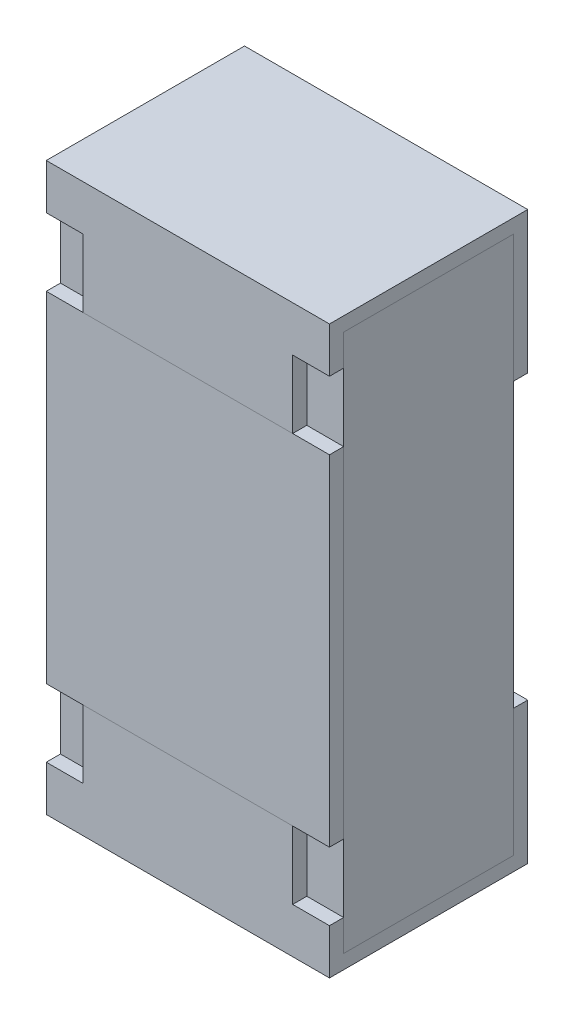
ISO-10303-21;
HEADER;
FILE_DESCRIPTION(('STEP AP214'),'2;1');
FILE_NAME('part.step','',(''),(''),'','','');
FILE_SCHEMA(('AUTOMOTIVE_DESIGN { 1 0 10303 214 1 1 1 1 }'));
ENDSEC;
DATA;
#1=APPLICATION_CONTEXT('core data for automotive mechanical design processes');
#2=APPLICATION_PROTOCOL_DEFINITION('international standard','automotive_design',2000,#1);
#3=PRODUCT_CONTEXT('',#1,'mechanical');
#4=PRODUCT('Part','Part','',(#3));
#5=PRODUCT_RELATED_PRODUCT_CATEGORY('part','',(#4));
#6=PRODUCT_DEFINITION_FORMATION('','',#4);
#7=PRODUCT_DEFINITION_CONTEXT('part definition',#1,'design');
#8=PRODUCT_DEFINITION('design','',#6,#7);
#9=PRODUCT_DEFINITION_SHAPE('','',#8);
#10=(LENGTH_UNIT() NAMED_UNIT(*) SI_UNIT(.MILLI.,.METRE.));
#11=(NAMED_UNIT(*) PLANE_ANGLE_UNIT() SI_UNIT($,.RADIAN.));
#12=(NAMED_UNIT(*) SI_UNIT($,.STERADIAN.) SOLID_ANGLE_UNIT());
#13=UNCERTAINTY_MEASURE_WITH_UNIT(LENGTH_MEASURE(1.E-05),#10,'distance_accuracy_value','');
#14=(GEOMETRIC_REPRESENTATION_CONTEXT(3) GLOBAL_UNCERTAINTY_ASSIGNED_CONTEXT((#13)) GLOBAL_UNIT_ASSIGNED_CONTEXT((#10,
#11,#12)) REPRESENTATION_CONTEXT('',''));
#15=CARTESIAN_POINT('',(0.,0.,0.));
#16=DIRECTION('',(0.,0.,1.));
#17=DIRECTION('',(1.,0.,0.));
#18=AXIS2_PLACEMENT_3D('',#15,#16,#17);
#19=CARTESIAN_POINT('',(15.435,34.38,0.355));
#20=DIRECTION('',(-1.,0.,0.));
#21=DIRECTION('',(0.,0.,1.));
#22=AXIS2_PLACEMENT_3D('',#19,#20,#21);
#23=PLANE('',#22);
#24=DIRECTION('',(0.,0.,-1.));
#25=VECTOR('',#24,1.);
#26=CARTESIAN_POINT('',(15.435,34.26,0.355));
#27=LINE('',#26,#25);
#28=CARTESIAN_POINT('',(15.435,34.26,0.38));
#29=VERTEX_POINT('',#28);
#30=CARTESIAN_POINT('',(15.435,34.26,0.355));
#31=VERTEX_POINT('',#30);
#32=EDGE_CURVE('P0_E20',#29,#31,#27,.T.);
#33=ORIENTED_EDGE('',*,*,#32,.T.);
#34=DIRECTION('',(0.,-1.,0.));
#35=VECTOR('',#34,1.);
#36=CARTESIAN_POINT('',(15.435,33.6918753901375,0.354999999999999));
#37=LINE('',#36,#35);
#38=CARTESIAN_POINT('',(15.435,34.38,0.355));
#39=VERTEX_POINT('',#38);
#40=EDGE_CURVE('P0_E103',#31,#39,#37,.F.);
#41=ORIENTED_EDGE('',*,*,#40,.T.);
#42=DIRECTION('',(0.,0.,1.));
#43=VECTOR('',#42,1.);
#44=CARTESIAN_POINT('',(15.435,34.38,0.38));
#45=LINE('',#44,#43);
#46=CARTESIAN_POINT('',(15.435,34.38,0.38));
#47=VERTEX_POINT('',#46);
#48=EDGE_CURVE('P0_E111',#39,#47,#45,.T.);
#49=ORIENTED_EDGE('',*,*,#48,.T.);
#50=DIRECTION('',(0.,1.,0.));
#51=VECTOR('',#50,1.);
#52=CARTESIAN_POINT('',(15.435,33.6918753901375,0.38));
#53=LINE('',#52,#51);
#54=EDGE_CURVE('P0_E108',#47,#29,#53,.F.);
#55=ORIENTED_EDGE('',*,*,#54,.T.);
#56=EDGE_LOOP('',(#33,#41,#49,#55));
#57=FACE_BOUND('',#56,.T.);
#58=ADVANCED_FACE('P0_F17',(#57),#23,.F.);
#59=CARTESIAN_POINT('',(15.5,34.26,0.355));
#60=DIRECTION('',(0.,-1.,0.));
#61=DIRECTION('',(0.,0.,-1.));
#62=AXIS2_PLACEMENT_3D('',#59,#60,#61);
#63=PLANE('',#62);
#64=DIRECTION('',(0.,0.,1.));
#65=VECTOR('',#64,1.);
#66=CARTESIAN_POINT('',(15.5,34.26,0.38));
#67=LINE('',#66,#65);
#68=CARTESIAN_POINT('',(15.5,34.26,0.38));
#69=VERTEX_POINT('',#68);
#70=CARTESIAN_POINT('',(15.5,34.26,0.355));
#71=VERTEX_POINT('',#70);
#72=EDGE_CURVE('P0_E116',#69,#71,#67,.F.);
#73=ORIENTED_EDGE('',*,*,#72,.T.);
#74=DIRECTION('',(1.,0.,0.));
#75=VECTOR('',#74,1.);
#76=CARTESIAN_POINT('',(15.5,34.26,0.354999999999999));
#77=LINE('',#76,#75);
#78=EDGE_CURVE('P0_E113',#71,#31,#77,.F.);
#79=ORIENTED_EDGE('',*,*,#78,.T.);
#80=ORIENTED_EDGE('',*,*,#32,.F.);
#81=DIRECTION('',(1.,0.,0.));
#82=VECTOR('',#81,1.);
#83=CARTESIAN_POINT('',(15.,34.26,0.38));
#84=LINE('',#83,#82);
#85=EDGE_CURVE('P0_E150',#29,#69,#84,.T.);
#86=ORIENTED_EDGE('',*,*,#85,.T.);
#87=EDGE_LOOP('',(#73,#79,#80,#86));
#88=FACE_BOUND('',#87,.T.);
#89=ADVANCED_FACE('P0_F114',(#88),#63,.F.);
#90=CARTESIAN_POINT('',(15.065,34.38,0.355));
#91=DIRECTION('',(1.,0.,0.));
#92=DIRECTION('',(0.,1.,0.));
#93=AXIS2_PLACEMENT_3D('',#90,#91,#92);
#94=PLANE('',#93);
#95=DIRECTION('',(0.,0.,1.));
#96=VECTOR('',#95,1.);
#97=CARTESIAN_POINT('',(15.065,34.38,0.38));
#98=LINE('',#97,#96);
#99=CARTESIAN_POINT('',(15.065,34.38,0.38));
#100=VERTEX_POINT('',#99);
#101=CARTESIAN_POINT('',(15.065,34.38,0.355));
#102=VERTEX_POINT('',#101);
#103=EDGE_CURVE('P0_E136',#100,#102,#98,.F.);
#104=ORIENTED_EDGE('',*,*,#103,.T.);
#105=DIRECTION('',(0.,-1.,0.));
#106=VECTOR('',#105,1.);
#107=CARTESIAN_POINT('',(15.065,33.6918753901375,0.354999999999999));
#108=LINE('',#107,#106);
#109=CARTESIAN_POINT('',(15.065,34.26,0.355));
#110=VERTEX_POINT('',#109);
#111=EDGE_CURVE('P0_E128',#102,#110,#108,.T.);
#112=ORIENTED_EDGE('',*,*,#111,.T.);
#113=DIRECTION('',(0.,0.,-1.));
#114=VECTOR('',#113,1.);
#115=CARTESIAN_POINT('',(15.065,34.26,0.355));
#116=LINE('',#115,#114);
#117=CARTESIAN_POINT('',(15.065,34.26,0.38));
#118=VERTEX_POINT('',#117);
#119=EDGE_CURVE('P0_E169',#110,#118,#116,.F.);
#120=ORIENTED_EDGE('',*,*,#119,.T.);
#121=DIRECTION('',(0.,1.,0.));
#122=VECTOR('',#121,1.);
#123=CARTESIAN_POINT('',(15.065,33.6918753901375,0.38));
#124=LINE('',#123,#122);
#125=EDGE_CURVE('P0_E146',#118,#100,#124,.T.);
#126=ORIENTED_EDGE('',*,*,#125,.T.);
#127=EDGE_LOOP('',(#104,#112,#120,#126));
#128=FACE_BOUND('',#127,.T.);
#129=ADVANCED_FACE('P0_F174',(#128),#94,.F.);
#130=CARTESIAN_POINT('',(15.,34.38,0.38));
#131=DIRECTION('',(0.,-1.,0.));
#132=DIRECTION('',(1.,0.,0.));
#133=AXIS2_PLACEMENT_3D('',#130,#131,#132);
#134=PLANE('',#133);
#135=ORIENTED_EDGE('',*,*,#103,.F.);
#136=DIRECTION('',(1.,0.,0.));
#137=VECTOR('',#136,1.);
#138=CARTESIAN_POINT('',(15.,34.38,0.38));
#139=LINE('',#138,#137);
#140=EDGE_CURVE('P0_E141',#100,#47,#139,.T.);
#141=ORIENTED_EDGE('',*,*,#140,.T.);
#142=ORIENTED_EDGE('',*,*,#48,.F.);
#143=DIRECTION('',(1.,0.,0.));
#144=VECTOR('',#143,1.);
#145=CARTESIAN_POINT('',(15.5,34.38,0.354999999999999));
#146=LINE('',#145,#144);
#147=EDGE_CURVE('P0_E126',#39,#102,#146,.F.);
#148=ORIENTED_EDGE('',*,*,#147,.T.);
#149=EDGE_LOOP('',(#135,#141,#142,#148));
#150=FACE_BOUND('',#149,.T.);
#151=ADVANCED_FACE('P0_F142',(#150),#134,.F.);
#152=CARTESIAN_POINT('',(15.5,34.205,0.0549999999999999));
#153=DIRECTION('',(0.,0.,-1.));
#154=DIRECTION('',(0.,1.,0.));
#155=AXIS2_PLACEMENT_3D('',#152,#153,#154);
#156=PLANE('',#155);
#157=DIRECTION('',(0.,1.,0.));
#158=VECTOR('',#157,1.);
#159=CARTESIAN_POINT('',(15.,33.6918753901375,0.0549999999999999));
#160=LINE('',#159,#158);
#161=CARTESIAN_POINT('',(15.,34.43,0.0549999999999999));
#162=VERTEX_POINT('',#161);
#163=CARTESIAN_POINT('',(15.,34.205,0.055));
#164=VERTEX_POINT('',#163);
#165=EDGE_CURVE('P0_E219',#162,#164,#160,.F.);
#166=ORIENTED_EDGE('',*,*,#165,.T.);
#167=DIRECTION('',(-1.,0.,0.));
#168=VECTOR('',#167,1.);
#169=CARTESIAN_POINT('',(15.5,34.205,0.0550000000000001));
#170=LINE('',#169,#168);
#171=CARTESIAN_POINT('',(15.5,34.205,0.055));
#172=VERTEX_POINT('',#171);
#173=EDGE_CURVE('P0_E133',#172,#164,#170,.T.);
#174=ORIENTED_EDGE('',*,*,#173,.F.);
#175=DIRECTION('',(0.,-1.,0.));
#176=VECTOR('',#175,1.);
#177=CARTESIAN_POINT('',(15.5,33.6918753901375,0.0550000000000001));
#178=LINE('',#177,#176);
#179=CARTESIAN_POINT('',(15.5,34.43,0.055));
#180=VERTEX_POINT('',#179);
#181=EDGE_CURVE('P0_E161',#172,#180,#178,.F.);
#182=ORIENTED_EDGE('',*,*,#181,.T.);
#183=DIRECTION('',(-1.,0.,0.));
#184=VECTOR('',#183,1.);
#185=CARTESIAN_POINT('',(15.25,34.43,0.0549999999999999));
#186=LINE('',#185,#184);
#187=EDGE_CURVE('P0_E166',#162,#180,#186,.F.);
#188=ORIENTED_EDGE('',*,*,#187,.F.);
#189=EDGE_LOOP('',(#166,#174,#182,#188));
#190=FACE_BOUND('',#189,.T.);
#191=ADVANCED_FACE('P0_F229',(#190),#156,.F.);
#192=CARTESIAN_POINT('',(15.5,34.205,0.355));
#193=DIRECTION('',(0.,1.,0.));
#194=DIRECTION('',(-1.,0.,0.));
#195=AXIS2_PLACEMENT_3D('',#192,#193,#194);
#196=PLANE('',#195);
#197=DIRECTION('',(0.,0.,1.));
#198=VECTOR('',#197,1.);
#199=CARTESIAN_POINT('',(15.5,34.205,0.38));
#200=LINE('',#199,#198);
#201=CARTESIAN_POINT('',(15.5,34.205,0.355));
#202=VERTEX_POINT('',#201);
#203=EDGE_CURVE('P0_E163',#202,#172,#200,.F.);
#204=ORIENTED_EDGE('',*,*,#203,.T.);
#205=ORIENTED_EDGE('',*,*,#173,.T.);
#206=DIRECTION('',(0.,0.,-1.));
#207=VECTOR('',#206,1.);
#208=CARTESIAN_POINT('',(15.,34.205,0.354999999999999));
#209=LINE('',#208,#207);
#210=CARTESIAN_POINT('',(15.,34.205,0.355));
#211=VERTEX_POINT('',#210);
#212=EDGE_CURVE('P0_E217',#164,#211,#209,.F.);
#213=ORIENTED_EDGE('',*,*,#212,.T.);
#214=DIRECTION('',(1.,0.,0.));
#215=VECTOR('',#214,1.);
#216=CARTESIAN_POINT('',(15.5,34.205,0.354999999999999));
#217=LINE('',#216,#215);
#218=EDGE_CURVE('P0_E120',#211,#202,#217,.T.);
#219=ORIENTED_EDGE('',*,*,#218,.T.);
#220=EDGE_LOOP('',(#204,#205,#213,#219));
#221=FACE_BOUND('',#220,.T.);
#222=ADVANCED_FACE('P0_F231',(#221),#196,.T.);
#223=CARTESIAN_POINT('',(15.5,33.6918753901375,0.354999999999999));
#224=DIRECTION('',(0.,0.,1.));
#225=DIRECTION('',(0.,-1.,0.));
#226=AXIS2_PLACEMENT_3D('',#223,#224,#225);
#227=PLANE('',#226);
#228=ORIENTED_EDGE('',*,*,#111,.F.);
#229=ORIENTED_EDGE('',*,*,#147,.F.);
#230=ORIENTED_EDGE('',*,*,#40,.F.);
#231=ORIENTED_EDGE('',*,*,#78,.F.);
#232=DIRECTION('',(0.,-1.,0.));
#233=VECTOR('',#232,1.);
#234=CARTESIAN_POINT('',(15.5,33.6918753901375,0.355));
#235=LINE('',#234,#233);
#236=EDGE_CURVE('P0_E151',#71,#202,#235,.T.);
#237=ORIENTED_EDGE('',*,*,#236,.T.);
#238=ORIENTED_EDGE('',*,*,#218,.F.);
#239=DIRECTION('',(0.,1.,0.));
#240=VECTOR('',#239,1.);
#241=CARTESIAN_POINT('',(15.,33.6918753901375,0.355));
#242=LINE('',#241,#240);
#243=CARTESIAN_POINT('',(15.,34.26,0.355));
#244=VERTEX_POINT('',#243);
#245=EDGE_CURVE('P0_E180',#211,#244,#242,.T.);
#246=ORIENTED_EDGE('',*,*,#245,.T.);
#247=DIRECTION('',(1.,0.,0.));
#248=VECTOR('',#247,1.);
#249=CARTESIAN_POINT('',(15.,34.26,0.355));
#250=LINE('',#249,#248);
#251=EDGE_CURVE('P0_E171',#244,#110,#250,.T.);
#252=ORIENTED_EDGE('',*,*,#251,.T.);
#253=EDGE_LOOP('',(#228,#229,#230,#231,#237,#238,#246,#252));
#254=FACE_BOUND('',#253,.T.);
#255=ADVANCED_FACE('P0_F124',(#254),#227,.F.);
#256=CARTESIAN_POINT('',(15.,34.26,0.355));
#257=DIRECTION('',(0.,-1.,0.));
#258=DIRECTION('',(0.,0.,-1.));
#259=AXIS2_PLACEMENT_3D('',#256,#257,#258);
#260=PLANE('',#259);
#261=ORIENTED_EDGE('',*,*,#119,.F.);
#262=ORIENTED_EDGE('',*,*,#251,.F.);
#263=DIRECTION('',(0.,0.,-1.));
#264=VECTOR('',#263,1.);
#265=CARTESIAN_POINT('',(15.,34.26,0.354999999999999));
#266=LINE('',#265,#264);
#267=CARTESIAN_POINT('',(15.,34.26,0.38));
#268=VERTEX_POINT('',#267);
#269=EDGE_CURVE('P0_E186',#244,#268,#266,.F.);
#270=ORIENTED_EDGE('',*,*,#269,.T.);
#271=DIRECTION('',(1.,0.,0.));
#272=VECTOR('',#271,1.);
#273=CARTESIAN_POINT('',(15.,34.26,0.38));
#274=LINE('',#273,#272);
#275=EDGE_CURVE('P0_E185',#268,#118,#274,.T.);
#276=ORIENTED_EDGE('',*,*,#275,.T.);
#277=EDGE_LOOP('',(#261,#262,#270,#276));
#278=FACE_BOUND('',#277,.T.);
#279=ADVANCED_FACE('P0_F183',(#278),#260,.F.);
#280=CARTESIAN_POINT('',(15.25,34.43,0.0425000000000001));
#281=DIRECTION('',(0.,1.,0.));
#282=DIRECTION('',(-1.,0.,0.));
#283=AXIS2_PLACEMENT_3D('',#280,#281,#282);
#284=PLANE('',#283);
#285=DIRECTION('',(0.,0.,1.));
#286=VECTOR('',#285,1.);
#287=CARTESIAN_POINT('',(15.5,34.43,0.38));
#288=LINE('',#287,#286);
#289=CARTESIAN_POINT('',(15.5,34.43,0.03));
#290=VERTEX_POINT('',#289);
#291=EDGE_CURVE('P0_E159',#180,#290,#288,.F.);
#292=ORIENTED_EDGE('',*,*,#291,.T.);
#293=DIRECTION('',(1.,0.,0.));
#294=VECTOR('',#293,1.);
#295=CARTESIAN_POINT('',(15.,34.43,0.03));
#296=LINE('',#295,#294);
#297=CARTESIAN_POINT('',(15.,34.43,0.03));
#298=VERTEX_POINT('',#297);
#299=EDGE_CURVE('P0_E205',#290,#298,#296,.F.);
#300=ORIENTED_EDGE('',*,*,#299,.T.);
#301=DIRECTION('',(0.,0.,-1.));
#302=VECTOR('',#301,1.);
#303=CARTESIAN_POINT('',(15.,34.43,0.354999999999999));
#304=LINE('',#303,#302);
#305=EDGE_CURVE('P0_E145',#298,#162,#304,.F.);
#306=ORIENTED_EDGE('',*,*,#305,.T.);
#307=ORIENTED_EDGE('',*,*,#187,.T.);
#308=EDGE_LOOP('',(#292,#300,#306,#307));
#309=FACE_BOUND('',#308,.T.);
#310=ADVANCED_FACE('P0_F223',(#309),#284,.T.);
#311=CARTESIAN_POINT('',(15.5,33.6918753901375,0.38));
#312=DIRECTION('',(-1.,0.,0.));
#313=DIRECTION('',(0.,-1.,0.));
#314=AXIS2_PLACEMENT_3D('',#311,#312,#313);
#315=PLANE('',#314);
#316=ORIENTED_EDGE('',*,*,#72,.F.);
#317=DIRECTION('',(0.,1.,0.));
#318=VECTOR('',#317,1.);
#319=CARTESIAN_POINT('',(15.5,33.6918753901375,0.38));
#320=LINE('',#319,#318);
#321=CARTESIAN_POINT('',(15.5,34.18,0.38));
#322=VERTEX_POINT('',#321);
#323=EDGE_CURVE('P0_E153',#69,#322,#320,.F.);
#324=ORIENTED_EDGE('',*,*,#323,.T.);
#325=DIRECTION('',(0.,0.,1.));
#326=VECTOR('',#325,1.);
#327=CARTESIAN_POINT('',(15.5,34.18,0.38));
#328=LINE('',#327,#326);
#329=CARTESIAN_POINT('',(15.5,34.18,0.03));
#330=VERTEX_POINT('',#329);
#331=EDGE_CURVE('P0_E196',#330,#322,#328,.T.);
#332=ORIENTED_EDGE('',*,*,#331,.F.);
#333=DIRECTION('',(0.,-1.,0.));
#334=VECTOR('',#333,1.);
#335=CARTESIAN_POINT('',(15.5,34.18,0.03));
#336=LINE('',#335,#334);
#337=EDGE_CURVE('P0_E208',#330,#290,#336,.F.);
#338=ORIENTED_EDGE('',*,*,#337,.T.);
#339=ORIENTED_EDGE('',*,*,#291,.F.);
#340=ORIENTED_EDGE('',*,*,#181,.F.);
#341=ORIENTED_EDGE('',*,*,#203,.F.);
#342=ORIENTED_EDGE('',*,*,#236,.F.);
#343=EDGE_LOOP('',(#316,#324,#332,#338,#339,#340,#341,#342));
#344=FACE_BOUND('',#343,.T.);
#345=ADVANCED_FACE('P0_F193',(#344),#315,.F.);
#346=CARTESIAN_POINT('',(15.,33.6918753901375,0.38));
#347=DIRECTION('',(0.,0.,-1.));
#348=DIRECTION('',(0.,1.,0.));
#349=AXIS2_PLACEMENT_3D('',#346,#347,#348);
#350=PLANE('',#349);
#351=ORIENTED_EDGE('',*,*,#125,.F.);
#352=ORIENTED_EDGE('',*,*,#275,.F.);
#353=DIRECTION('',(0.,1.,0.));
#354=VECTOR('',#353,1.);
#355=CARTESIAN_POINT('',(15.,33.6918753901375,0.38));
#356=LINE('',#355,#354);
#357=CARTESIAN_POINT('',(15.,34.18,0.38));
#358=VERTEX_POINT('',#357);
#359=EDGE_CURVE('P0_E200',#268,#358,#356,.F.);
#360=ORIENTED_EDGE('',*,*,#359,.T.);
#361=DIRECTION('',(1.,0.,0.));
#362=VECTOR('',#361,1.);
#363=CARTESIAN_POINT('',(15.,34.18,0.38));
#364=LINE('',#363,#362);
#365=EDGE_CURVE('P0_E199',#322,#358,#364,.F.);
#366=ORIENTED_EDGE('',*,*,#365,.F.);
#367=ORIENTED_EDGE('',*,*,#323,.F.);
#368=ORIENTED_EDGE('',*,*,#85,.F.);
#369=ORIENTED_EDGE('',*,*,#54,.F.);
#370=ORIENTED_EDGE('',*,*,#140,.F.);
#371=EDGE_LOOP('',(#351,#352,#360,#366,#367,#368,#369,#370));
#372=FACE_BOUND('',#371,.T.);
#373=ADVANCED_FACE('P0_F148',(#372),#350,.F.);
#374=CARTESIAN_POINT('',(15.,33.6918753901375,0.354999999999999));
#375=DIRECTION('',(1.,0.,0.));
#376=DIRECTION('',(0.,0.,-1.));
#377=AXIS2_PLACEMENT_3D('',#374,#375,#376);
#378=PLANE('',#377);
#379=ORIENTED_EDGE('',*,*,#269,.F.);
#380=ORIENTED_EDGE('',*,*,#245,.F.);
#381=ORIENTED_EDGE('',*,*,#212,.F.);
#382=ORIENTED_EDGE('',*,*,#165,.F.);
#383=ORIENTED_EDGE('',*,*,#305,.F.);
#384=DIRECTION('',(0.,-1.,0.));
#385=VECTOR('',#384,1.);
#386=CARTESIAN_POINT('',(15.,34.18,0.03));
#387=LINE('',#386,#385);
#388=CARTESIAN_POINT('',(15.,34.18,0.0299999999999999));
#389=VERTEX_POINT('',#388);
#390=EDGE_CURVE('P0_E35',#298,#389,#387,.T.);
#391=ORIENTED_EDGE('',*,*,#390,.T.);
#392=DIRECTION('',(0.,0.,1.));
#393=VECTOR('',#392,1.);
#394=CARTESIAN_POINT('',(15.,34.18,0.38));
#395=LINE('',#394,#393);
#396=EDGE_CURVE('P0_E26',#358,#389,#395,.F.);
#397=ORIENTED_EDGE('',*,*,#396,.F.);
#398=ORIENTED_EDGE('',*,*,#359,.F.);
#399=EDGE_LOOP('',(#379,#380,#381,#382,#383,#391,#397,#398));
#400=FACE_BOUND('',#399,.T.);
#401=ADVANCED_FACE('P0_F227',(#400),#378,.F.);
#402=CARTESIAN_POINT('',(15.,34.18,0.03));
#403=DIRECTION('',(0.,0.,1.));
#404=DIRECTION('',(0.,-1.,0.));
#405=AXIS2_PLACEMENT_3D('',#402,#403,#404);
#406=PLANE('',#405);
#407=ORIENTED_EDGE('',*,*,#337,.F.);
#408=DIRECTION('',(1.,0.,0.));
#409=VECTOR('',#408,1.);
#410=CARTESIAN_POINT('',(15.,34.18,0.0299999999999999));
#411=LINE('',#410,#409);
#412=EDGE_CURVE('P0_E11',#389,#330,#411,.T.);
#413=ORIENTED_EDGE('',*,*,#412,.F.);
#414=ORIENTED_EDGE('',*,*,#390,.F.);
#415=ORIENTED_EDGE('',*,*,#299,.F.);
#416=EDGE_LOOP('',(#407,#413,#414,#415));
#417=FACE_BOUND('',#416,.T.);
#418=ADVANCED_FACE('P0_F235',(#417),#406,.F.);
#419=CARTESIAN_POINT('',(15.,34.18,0.38));
#420=DIRECTION('',(0.,-1.,0.));
#421=DIRECTION('',(1.,0.,0.));
#422=AXIS2_PLACEMENT_3D('',#419,#420,#421);
#423=PLANE('',#422);
#424=ORIENTED_EDGE('',*,*,#396,.T.);
#425=ORIENTED_EDGE('',*,*,#412,.T.);
#426=ORIENTED_EDGE('',*,*,#331,.T.);
#427=ORIENTED_EDGE('',*,*,#365,.T.);
#428=EDGE_LOOP('',(#424,#425,#426,#427));
#429=FACE_BOUND('',#428,.T.);
#430=ADVANCED_FACE('P0_F204',(#429),#423,.T.);
#431=CLOSED_SHELL('',(#58,#89,#129,#151,#191,#222,#255,#279,#310,#345,#373,#401,#418,#430));
#432=MANIFOLD_SOLID_BREP('P0_B1',#431);
#433=CARTESIAN_POINT('',(15.5,35.155,0.355));
#434=DIRECTION('',(0.,0.,-1.));
#435=DIRECTION('',(-1.,0.,0.));
#436=AXIS2_PLACEMENT_3D('',#433,#434,#435);
#437=PLANE('',#436);
#438=DIRECTION('',(-1.,0.,0.));
#439=VECTOR('',#438,1.);
#440=CARTESIAN_POINT('',(15.5,34.205,0.355));
#441=LINE('',#440,#439);
#442=CARTESIAN_POINT('',(15.,34.205,0.355));
#443=VERTEX_POINT('',#442);
#444=CARTESIAN_POINT('',(15.5,34.205,0.355));
#445=VERTEX_POINT('',#444);
#446=EDGE_CURVE('P1_E20',#443,#445,#441,.F.);
#447=ORIENTED_EDGE('',*,*,#446,.T.);
#448=DIRECTION('',(0.,-1.,0.));
#449=VECTOR('',#448,1.);
#450=CARTESIAN_POINT('',(15.5,34.205,0.355));
#451=LINE('',#450,#449);
#452=CARTESIAN_POINT('',(15.5,35.155,0.355));
#453=VERTEX_POINT('',#452);
#454=EDGE_CURVE('P1_E55',#445,#453,#451,.F.);
#455=ORIENTED_EDGE('',*,*,#454,.T.);
#456=DIRECTION('',(1.,0.,0.));
#457=VECTOR('',#456,1.);
#458=CARTESIAN_POINT('',(15.5,35.155,0.355));
#459=LINE('',#458,#457);
#460=CARTESIAN_POINT('',(15.,35.155,0.355));
#461=VERTEX_POINT('',#460);
#462=EDGE_CURVE('P1_E76',#453,#461,#459,.F.);
#463=ORIENTED_EDGE('',*,*,#462,.T.);
#464=DIRECTION('',(0.,1.,0.));
#465=VECTOR('',#464,1.);
#466=CARTESIAN_POINT('',(15.,34.205,0.355));
#467=LINE('',#466,#465);
#468=EDGE_CURVE('P1_E58',#461,#443,#467,.F.);
#469=ORIENTED_EDGE('',*,*,#468,.T.);
#470=EDGE_LOOP('',(#447,#455,#463,#469));
#471=FACE_BOUND('',#470,.T.);
#472=ADVANCED_FACE('P1_F17',(#471),#437,.F.);
#473=CARTESIAN_POINT('',(15.5,34.205,0.38));
#474=DIRECTION('',(0.,1.,0.));
#475=DIRECTION('',(-1.,0.,0.));
#476=AXIS2_PLACEMENT_3D('',#473,#474,#475);
#477=PLANE('',#476);
#478=ORIENTED_EDGE('',*,*,#446,.F.);
#479=DIRECTION('',(0.,0.,1.));
#480=VECTOR('',#479,1.);
#481=CARTESIAN_POINT('',(15.,34.205,0.38));
#482=LINE('',#481,#480);
#483=CARTESIAN_POINT('',(15.,34.205,0.055));
#484=VERTEX_POINT('',#483);
#485=EDGE_CURVE('P1_E80',#443,#484,#482,.F.);
#486=ORIENTED_EDGE('',*,*,#485,.T.);
#487=DIRECTION('',(1.,0.,0.));
#488=VECTOR('',#487,1.);
#489=CARTESIAN_POINT('',(15.5,34.205,0.055));
#490=LINE('',#489,#488);
#491=CARTESIAN_POINT('',(15.5,34.205,0.055));
#492=VERTEX_POINT('',#491);
#493=EDGE_CURVE('P1_E73',#484,#492,#490,.T.);
#494=ORIENTED_EDGE('',*,*,#493,.T.);
#495=DIRECTION('',(0.,0.,1.));
#496=VECTOR('',#495,1.);
#497=CARTESIAN_POINT('',(15.5,34.205,0.38));
#498=LINE('',#497,#496);
#499=EDGE_CURVE('P1_E63',#492,#445,#498,.T.);
#500=ORIENTED_EDGE('',*,*,#499,.T.);
#501=EDGE_LOOP('',(#478,#486,#494,#500));
#502=FACE_BOUND('',#501,.T.);
#503=ADVANCED_FACE('P1_F72',(#502),#477,.F.);
#504=CARTESIAN_POINT('',(15.5,34.205,0.38));
#505=DIRECTION('',(-1.,0.,0.));
#506=DIRECTION('',(0.,-1.,0.));
#507=AXIS2_PLACEMENT_3D('',#504,#505,#506);
#508=PLANE('',#507);
#509=ORIENTED_EDGE('',*,*,#454,.F.);
#510=ORIENTED_EDGE('',*,*,#499,.F.);
#511=DIRECTION('',(0.,1.,0.));
#512=VECTOR('',#511,1.);
#513=CARTESIAN_POINT('',(15.5,35.155,0.055));
#514=LINE('',#513,#512);
#515=CARTESIAN_POINT('',(15.5,35.155,0.055));
#516=VERTEX_POINT('',#515);
#517=EDGE_CURVE('P1_E83',#492,#516,#514,.T.);
#518=ORIENTED_EDGE('',*,*,#517,.T.);
#519=DIRECTION('',(0.,0.,1.));
#520=VECTOR('',#519,1.);
#521=CARTESIAN_POINT('',(15.5,35.155,0.38));
#522=LINE('',#521,#520);
#523=EDGE_CURVE('P1_E69',#516,#453,#522,.T.);
#524=ORIENTED_EDGE('',*,*,#523,.T.);
#525=EDGE_LOOP('',(#509,#510,#518,#524));
#526=FACE_BOUND('',#525,.T.);
#527=ADVANCED_FACE('P1_F66',(#526),#508,.F.);
#528=CARTESIAN_POINT('',(15.5,35.155,0.38));
#529=DIRECTION('',(0.,-1.,0.));
#530=DIRECTION('',(1.,0.,0.));
#531=AXIS2_PLACEMENT_3D('',#528,#529,#530);
#532=PLANE('',#531);
#533=ORIENTED_EDGE('',*,*,#462,.F.);
#534=ORIENTED_EDGE('',*,*,#523,.F.);
#535=DIRECTION('',(1.,0.,0.));
#536=VECTOR('',#535,1.);
#537=CARTESIAN_POINT('',(15.5,35.155,0.055));
#538=LINE('',#537,#536);
#539=CARTESIAN_POINT('',(15.,35.155,0.055));
#540=VERTEX_POINT('',#539);
#541=EDGE_CURVE('P1_E26',#516,#540,#538,.F.);
#542=ORIENTED_EDGE('',*,*,#541,.T.);
#543=DIRECTION('',(0.,0.,1.));
#544=VECTOR('',#543,1.);
#545=CARTESIAN_POINT('',(15.,35.155,0.38));
#546=LINE('',#545,#544);
#547=EDGE_CURVE('P1_E34',#540,#461,#546,.T.);
#548=ORIENTED_EDGE('',*,*,#547,.T.);
#549=EDGE_LOOP('',(#533,#534,#542,#548));
#550=FACE_BOUND('',#549,.T.);
#551=ADVANCED_FACE('P1_F88',(#550),#532,.F.);
#552=CARTESIAN_POINT('',(15.,34.205,0.38));
#553=DIRECTION('',(1.,0.,0.));
#554=DIRECTION('',(0.,1.,0.));
#555=AXIS2_PLACEMENT_3D('',#552,#553,#554);
#556=PLANE('',#555);
#557=ORIENTED_EDGE('',*,*,#468,.F.);
#558=ORIENTED_EDGE('',*,*,#547,.F.);
#559=DIRECTION('',(0.,1.,0.));
#560=VECTOR('',#559,1.);
#561=CARTESIAN_POINT('',(15.,35.155,0.055));
#562=LINE('',#561,#560);
#563=EDGE_CURVE('P1_E11',#540,#484,#562,.F.);
#564=ORIENTED_EDGE('',*,*,#563,.T.);
#565=ORIENTED_EDGE('',*,*,#485,.F.);
#566=EDGE_LOOP('',(#557,#558,#564,#565));
#567=FACE_BOUND('',#566,.T.);
#568=ADVANCED_FACE('P1_F91',(#567),#556,.F.);
#569=CARTESIAN_POINT('',(15.5,35.155,0.055));
#570=DIRECTION('',(0.,0.,1.));
#571=DIRECTION('',(1.,0.,0.));
#572=AXIS2_PLACEMENT_3D('',#569,#570,#571);
#573=PLANE('',#572);
#574=ORIENTED_EDGE('',*,*,#541,.F.);
#575=ORIENTED_EDGE('',*,*,#517,.F.);
#576=ORIENTED_EDGE('',*,*,#493,.F.);
#577=ORIENTED_EDGE('',*,*,#563,.F.);
#578=EDGE_LOOP('',(#574,#575,#576,#577));
#579=FACE_BOUND('',#578,.T.);
#580=ADVANCED_FACE('P1_F90',(#579),#573,.F.);
#581=CLOSED_SHELL('',(#472,#503,#527,#551,#568,#580));
#582=MANIFOLD_SOLID_BREP('P1_B1',#581);
#583=CARTESIAN_POINT('',(15.0000000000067,-499965.32,0.355));
#584=DIRECTION('',(0.,0.,1.));
#585=DIRECTION('',(1.,0.,0.));
#586=AXIS2_PLACEMENT_3D('',#583,#584,#585);
#587=PLANE('',#586);
#588=DIRECTION('',(1.,0.,0.));
#589=VECTOR('',#588,1.);
#590=CARTESIAN_POINT('',(15.,34.38,0.355));
#591=LINE('',#590,#589);
#592=CARTESIAN_POINT('',(15.,34.3799999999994,0.355));
#593=VERTEX_POINT('',#592);
#594=CARTESIAN_POINT('',(15.5,34.3799999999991,0.355));
#595=VERTEX_POINT('',#594);
#596=EDGE_CURVE('P2_E76',#593,#595,#591,.T.);
#597=ORIENTED_EDGE('',*,*,#596,.F.);
#598=DIRECTION('',(0.,1.,0.));
#599=VECTOR('',#598,1.);
#600=CARTESIAN_POINT('',(15.0000000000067,-499965.32,0.355));
#601=LINE('',#600,#599);
#602=CARTESIAN_POINT('',(15.,34.9800000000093,0.355));
#603=VERTEX_POINT('',#602);
#604=EDGE_CURVE('P2_E58',#593,#603,#601,.T.);
#605=ORIENTED_EDGE('',*,*,#604,.T.);
#606=DIRECTION('',(1.,0.,0.));
#607=VECTOR('',#606,1.);
#608=CARTESIAN_POINT('',(15.,34.98,0.355));
#609=LINE('',#608,#607);
#610=CARTESIAN_POINT('',(15.5,34.9800000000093,0.355));
#611=VERTEX_POINT('',#610);
#612=EDGE_CURVE('P2_E20',#603,#611,#609,.T.);
#613=ORIENTED_EDGE('',*,*,#612,.T.);
#614=DIRECTION('',(0.,1.,0.));
#615=VECTOR('',#614,1.);
#616=CARTESIAN_POINT('',(15.5000000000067,-499965.32,0.355));
#617=LINE('',#616,#615);
#618=EDGE_CURVE('P2_E55',#611,#595,#617,.F.);
#619=ORIENTED_EDGE('',*,*,#618,.T.);
#620=EDGE_LOOP('',(#597,#605,#613,#619));
#621=FACE_BOUND('',#620,.T.);
#622=ADVANCED_FACE('P2_F17',(#621),#587,.F.);
#623=CARTESIAN_POINT('',(15.,34.98,0.355));
#624=DIRECTION('',(0.,-1.,0.));
#625=DIRECTION('',(1.,0.,0.));
#626=AXIS2_PLACEMENT_3D('',#623,#624,#625);
#627=PLANE('',#626);
#628=ORIENTED_EDGE('',*,*,#612,.F.);
#629=DIRECTION('',(0.,0.,-1.));
#630=VECTOR('',#629,1.);
#631=CARTESIAN_POINT('',(15.,34.9800000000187,0.38));
#632=LINE('',#631,#630);
#633=CARTESIAN_POINT('',(15.,34.9800000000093,0.38));
#634=VERTEX_POINT('',#633);
#635=EDGE_CURVE('P2_E78',#603,#634,#632,.F.);
#636=ORIENTED_EDGE('',*,*,#635,.T.);
#637=DIRECTION('',(-1.,0.,0.));
#638=VECTOR('',#637,1.);
#639=CARTESIAN_POINT('',(15.0000000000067,34.9800000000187,0.38));
#640=LINE('',#639,#638);
#641=CARTESIAN_POINT('',(15.5,34.9800000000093,0.38));
#642=VERTEX_POINT('',#641);
#643=EDGE_CURVE('P2_E73',#634,#642,#640,.F.);
#644=ORIENTED_EDGE('',*,*,#643,.T.);
#645=DIRECTION('',(0.,0.,1.));
#646=VECTOR('',#645,1.);
#647=CARTESIAN_POINT('',(15.5,34.9800000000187,0.38));
#648=LINE('',#647,#646);
#649=EDGE_CURVE('P2_E63',#642,#611,#648,.F.);
#650=ORIENTED_EDGE('',*,*,#649,.T.);
#651=EDGE_LOOP('',(#628,#636,#644,#650));
#652=FACE_BOUND('',#651,.T.);
#653=ADVANCED_FACE('P2_F72',(#652),#627,.F.);
#654=CARTESIAN_POINT('',(15.5000000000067,-499965.32,0.38));
#655=DIRECTION('',(-1.,0.,0.));
#656=DIRECTION('',(0.,0.,1.));
#657=AXIS2_PLACEMENT_3D('',#654,#655,#656);
#658=PLANE('',#657);
#659=DIRECTION('',(0.,0.,1.));
#660=VECTOR('',#659,1.);
#661=CARTESIAN_POINT('',(15.5,34.38,0.38));
#662=LINE('',#661,#660);
#663=CARTESIAN_POINT('',(15.5,34.3799999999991,0.38));
#664=VERTEX_POINT('',#663);
#665=EDGE_CURVE('P2_E69',#595,#664,#662,.T.);
#666=ORIENTED_EDGE('',*,*,#665,.F.);
#667=ORIENTED_EDGE('',*,*,#618,.F.);
#668=ORIENTED_EDGE('',*,*,#649,.F.);
#669=DIRECTION('',(0.,1.,0.));
#670=VECTOR('',#669,1.);
#671=CARTESIAN_POINT('',(15.5,-499965.32,0.38));
#672=LINE('',#671,#670);
#673=EDGE_CURVE('P2_E83',#642,#664,#672,.F.);
#674=ORIENTED_EDGE('',*,*,#673,.T.);
#675=EDGE_LOOP('',(#666,#667,#668,#674));
#676=FACE_BOUND('',#675,.T.);
#677=ADVANCED_FACE('P2_F66',(#676),#658,.F.);
#678=CARTESIAN_POINT('',(15.,34.38,0.38));
#679=DIRECTION('',(0.,-1.,0.));
#680=DIRECTION('',(1.,0.,0.));
#681=AXIS2_PLACEMENT_3D('',#678,#679,#680);
#682=PLANE('',#681);
#683=DIRECTION('',(0.,0.,-1.));
#684=VECTOR('',#683,1.);
#685=CARTESIAN_POINT('',(15.,34.3799999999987,0.38));
#686=LINE('',#685,#684);
#687=CARTESIAN_POINT('',(15.,34.3799999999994,0.38));
#688=VERTEX_POINT('',#687);
#689=EDGE_CURVE('P2_E34',#688,#593,#686,.T.);
#690=ORIENTED_EDGE('',*,*,#689,.T.);
#691=ORIENTED_EDGE('',*,*,#596,.T.);
#692=ORIENTED_EDGE('',*,*,#665,.T.);
#693=DIRECTION('',(-1.,0.,0.));
#694=VECTOR('',#693,1.);
#695=CARTESIAN_POINT('',(15.0000000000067,34.3799999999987,0.38));
#696=LINE('',#695,#694);
#697=EDGE_CURVE('P2_E26',#664,#688,#696,.T.);
#698=ORIENTED_EDGE('',*,*,#697,.T.);
#699=EDGE_LOOP('',(#690,#691,#692,#698));
#700=FACE_BOUND('',#699,.T.);
#701=ADVANCED_FACE('P2_F88',(#700),#682,.T.);
#702=CARTESIAN_POINT('',(15.0000000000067,-499965.32,0.38));
#703=DIRECTION('',(1.,0.,0.));
#704=DIRECTION('',(0.,0.,-1.));
#705=AXIS2_PLACEMENT_3D('',#702,#703,#704);
#706=PLANE('',#705);
#707=ORIENTED_EDGE('',*,*,#689,.F.);
#708=DIRECTION('',(0.,1.,0.));
#709=VECTOR('',#708,1.);
#710=CARTESIAN_POINT('',(15.,-499965.32,0.38));
#711=LINE('',#710,#709);
#712=EDGE_CURVE('P2_E11',#688,#634,#711,.T.);
#713=ORIENTED_EDGE('',*,*,#712,.T.);
#714=ORIENTED_EDGE('',*,*,#635,.F.);
#715=ORIENTED_EDGE('',*,*,#604,.F.);
#716=EDGE_LOOP('',(#707,#713,#714,#715));
#717=FACE_BOUND('',#716,.T.);
#718=ADVANCED_FACE('P2_F91',(#717),#706,.F.);
#719=CARTESIAN_POINT('',(15.0000000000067,-499965.32,0.38));
#720=DIRECTION('',(0.,0.,-1.));
#721=DIRECTION('',(-1.,0.,0.));
#722=AXIS2_PLACEMENT_3D('',#719,#720,#721);
#723=PLANE('',#722);
#724=ORIENTED_EDGE('',*,*,#697,.F.);
#725=ORIENTED_EDGE('',*,*,#673,.F.);
#726=ORIENTED_EDGE('',*,*,#643,.F.);
#727=ORIENTED_EDGE('',*,*,#712,.F.);
#728=EDGE_LOOP('',(#724,#725,#726,#727));
#729=FACE_BOUND('',#728,.T.);
#730=ADVANCED_FACE('P2_F90',(#729),#723,.F.);
#731=CLOSED_SHELL('',(#622,#653,#677,#701,#718,#730));
#732=MANIFOLD_SOLID_BREP('P2_B1',#731);
#733=CARTESIAN_POINT('',(15.5,35.155,0.355));
#734=DIRECTION('',(0.,-1.,0.));
#735=DIRECTION('',(1.,0.,0.));
#736=AXIS2_PLACEMENT_3D('',#733,#734,#735);
#737=PLANE('',#736);
#738=DIRECTION('',(0.,0.,1.));
#739=VECTOR('',#738,1.);
#740=CARTESIAN_POINT('',(15.5,35.155,0.38));
#741=LINE('',#740,#739);
#742=CARTESIAN_POINT('',(15.5,35.155,0.055));
#743=VERTEX_POINT('',#742);
#744=CARTESIAN_POINT('',(15.5,35.155,0.355));
#745=VERTEX_POINT('',#744);
#746=EDGE_CURVE('P3_E143',#743,#745,#741,.T.);
#747=ORIENTED_EDGE('',*,*,#746,.T.);
#748=DIRECTION('',(1.,0.,0.));
#749=VECTOR('',#748,1.);
#750=CARTESIAN_POINT('',(15.5,35.155,0.355));
#751=LINE('',#750,#749);
#752=CARTESIAN_POINT('',(15.,35.155,0.355));
#753=VERTEX_POINT('',#752);
#754=EDGE_CURVE('P3_E116',#745,#753,#751,.F.);
#755=ORIENTED_EDGE('',*,*,#754,.T.);
#756=DIRECTION('',(0.,0.,-1.));
#757=VECTOR('',#756,1.);
#758=CARTESIAN_POINT('',(15.,35.155,0.355));
#759=LINE('',#758,#757);
#760=CARTESIAN_POINT('',(15.,35.155,0.0550000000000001));
#761=VERTEX_POINT('',#760);
#762=EDGE_CURVE('P3_E145',#753,#761,#759,.T.);
#763=ORIENTED_EDGE('',*,*,#762,.T.);
#764=DIRECTION('',(-1.,0.,0.));
#765=VECTOR('',#764,1.);
#766=CARTESIAN_POINT('',(15.5,35.155,0.0549999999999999));
#767=LINE('',#766,#765);
#768=EDGE_CURVE('P3_E20',#761,#743,#767,.F.);
#769=ORIENTED_EDGE('',*,*,#768,.T.);
#770=EDGE_LOOP('',(#747,#755,#763,#769));
#771=FACE_BOUND('',#770,.T.);
#772=ADVANCED_FACE('P3_F17',(#771),#737,.T.);
#773=CARTESIAN_POINT('',(15.5,35.155,0.0549999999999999));
#774=DIRECTION('',(0.,0.,-1.));
#775=DIRECTION('',(-1.,0.,0.));
#776=AXIS2_PLACEMENT_3D('',#773,#774,#775);
#777=PLANE('',#776);
#778=DIRECTION('',(0.,-1.,0.));
#779=VECTOR('',#778,1.);
#780=CARTESIAN_POINT('',(15.5,35.6681246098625,0.0550000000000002));
#781=LINE('',#780,#779);
#782=CARTESIAN_POINT('',(15.5,34.93,0.0550000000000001));
#783=VERTEX_POINT('',#782);
#784=EDGE_CURVE('P3_E149',#783,#743,#781,.F.);
#785=ORIENTED_EDGE('',*,*,#784,.T.);
#786=ORIENTED_EDGE('',*,*,#768,.F.);
#787=DIRECTION('',(0.,1.,0.));
#788=VECTOR('',#787,1.);
#789=CARTESIAN_POINT('',(15.,35.6681246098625,0.0550000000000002));
#790=LINE('',#789,#788);
#791=CARTESIAN_POINT('',(15.,34.93,0.0550000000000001));
#792=VERTEX_POINT('',#791);
#793=EDGE_CURVE('P3_E193',#761,#792,#790,.F.);
#794=ORIENTED_EDGE('',*,*,#793,.T.);
#795=DIRECTION('',(1.,0.,0.));
#796=VECTOR('',#795,1.);
#797=CARTESIAN_POINT('',(15.25,34.93,0.0550000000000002));
#798=LINE('',#797,#796);
#799=EDGE_CURVE('P3_E134',#783,#792,#798,.F.);
#800=ORIENTED_EDGE('',*,*,#799,.F.);
#801=EDGE_LOOP('',(#785,#786,#794,#800));
#802=FACE_BOUND('',#801,.T.);
#803=ADVANCED_FACE('P3_F150',(#802),#777,.F.);
#804=CARTESIAN_POINT('',(15.25,34.93,0.0425000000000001));
#805=DIRECTION('',(0.,-1.,0.));
#806=DIRECTION('',(1.,0.,0.));
#807=AXIS2_PLACEMENT_3D('',#804,#805,#806);
#808=PLANE('',#807);
#809=DIRECTION('',(0.,0.,1.));
#810=VECTOR('',#809,1.);
#811=CARTESIAN_POINT('',(15.5,34.93,0.38));
#812=LINE('',#811,#810);
#813=CARTESIAN_POINT('',(15.5,34.93,0.03));
#814=VERTEX_POINT('',#813);
#815=EDGE_CURVE('P3_E152',#814,#783,#812,.T.);
#816=ORIENTED_EDGE('',*,*,#815,.T.);
#817=ORIENTED_EDGE('',*,*,#799,.T.);
#818=DIRECTION('',(0.,0.,-1.));
#819=VECTOR('',#818,1.);
#820=CARTESIAN_POINT('',(15.,34.93,0.355));
#821=LINE('',#820,#819);
#822=CARTESIAN_POINT('',(15.,34.93,0.03));
#823=VERTEX_POINT('',#822);
#824=EDGE_CURVE('P3_E196',#792,#823,#821,.T.);
#825=ORIENTED_EDGE('',*,*,#824,.T.);
#826=DIRECTION('',(1.,0.,0.));
#827=VECTOR('',#826,1.);
#828=CARTESIAN_POINT('',(15.,34.93,0.0300000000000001));
#829=LINE('',#828,#827);
#830=EDGE_CURVE('P3_E194',#823,#814,#829,.T.);
#831=ORIENTED_EDGE('',*,*,#830,.T.);
#832=EDGE_LOOP('',(#816,#817,#825,#831));
#833=FACE_BOUND('',#832,.T.);
#834=ADVANCED_FACE('P3_F218',(#833),#808,.T.);
#835=CARTESIAN_POINT('',(15.5,35.6681246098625,0.355));
#836=DIRECTION('',(0.,0.,1.));
#837=DIRECTION('',(0.,-1.,0.));
#838=AXIS2_PLACEMENT_3D('',#835,#836,#837);
#839=PLANE('',#838);
#840=DIRECTION('',(1.,0.,0.));
#841=VECTOR('',#840,1.);
#842=CARTESIAN_POINT('',(15.,35.1,0.355));
#843=LINE('',#842,#841);
#844=CARTESIAN_POINT('',(15.065,35.1,0.355));
#845=VERTEX_POINT('',#844);
#846=CARTESIAN_POINT('',(15.,35.1,0.355));
#847=VERTEX_POINT('',#846);
#848=EDGE_CURVE('P3_E161',#845,#847,#843,.F.);
#849=ORIENTED_EDGE('',*,*,#848,.T.);
#850=DIRECTION('',(0.,1.,0.));
#851=VECTOR('',#850,1.);
#852=CARTESIAN_POINT('',(15.,35.6681246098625,0.355));
#853=LINE('',#852,#851);
#854=EDGE_CURVE('P3_E189',#847,#753,#853,.T.);
#855=ORIENTED_EDGE('',*,*,#854,.T.);
#856=ORIENTED_EDGE('',*,*,#754,.F.);
#857=DIRECTION('',(0.,-1.,0.));
#858=VECTOR('',#857,1.);
#859=CARTESIAN_POINT('',(15.5,35.6681246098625,0.355));
#860=LINE('',#859,#858);
#861=CARTESIAN_POINT('',(15.5,35.1,0.355));
#862=VERTEX_POINT('',#861);
#863=EDGE_CURVE('P3_E112',#745,#862,#860,.T.);
#864=ORIENTED_EDGE('',*,*,#863,.T.);
#865=DIRECTION('',(1.,0.,0.));
#866=VECTOR('',#865,1.);
#867=CARTESIAN_POINT('',(15.5,35.1,0.355));
#868=LINE('',#867,#866);
#869=CARTESIAN_POINT('',(15.435,35.1,0.355));
#870=VERTEX_POINT('',#869);
#871=EDGE_CURVE('P3_E107',#862,#870,#868,.F.);
#872=ORIENTED_EDGE('',*,*,#871,.T.);
#873=DIRECTION('',(0.,-1.,0.));
#874=VECTOR('',#873,1.);
#875=CARTESIAN_POINT('',(15.435,34.98,0.355));
#876=LINE('',#875,#874);
#877=CARTESIAN_POINT('',(15.435,34.98,0.355));
#878=VERTEX_POINT('',#877);
#879=EDGE_CURVE('P3_E104',#870,#878,#876,.T.);
#880=ORIENTED_EDGE('',*,*,#879,.T.);
#881=DIRECTION('',(-1.,0.,0.));
#882=VECTOR('',#881,1.);
#883=CARTESIAN_POINT('',(15.,34.98,0.355));
#884=LINE('',#883,#882);
#885=CARTESIAN_POINT('',(15.065,34.98,0.355));
#886=VERTEX_POINT('',#885);
#887=EDGE_CURVE('P3_E130',#878,#886,#884,.T.);
#888=ORIENTED_EDGE('',*,*,#887,.T.);
#889=DIRECTION('',(0.,1.,0.));
#890=VECTOR('',#889,1.);
#891=CARTESIAN_POINT('',(15.065,34.98,0.355));
#892=LINE('',#891,#890);
#893=EDGE_CURVE('P3_E166',#886,#845,#892,.T.);
#894=ORIENTED_EDGE('',*,*,#893,.T.);
#895=EDGE_LOOP('',(#849,#855,#856,#864,#872,#880,#888,#894));
#896=FACE_BOUND('',#895,.T.);
#897=ADVANCED_FACE('P3_F109',(#896),#839,.F.);
#898=CARTESIAN_POINT('',(15.5,35.1,0.355));
#899=DIRECTION('',(0.,1.,0.));
#900=DIRECTION('',(0.,0.,1.));
#901=AXIS2_PLACEMENT_3D('',#898,#899,#900);
#902=PLANE('',#901);
#903=DIRECTION('',(0.,0.,1.));
#904=VECTOR('',#903,1.);
#905=CARTESIAN_POINT('',(15.435,35.1,0.355));
#906=LINE('',#905,#904);
#907=CARTESIAN_POINT('',(15.435,35.1,0.38));
#908=VERTEX_POINT('',#907);
#909=EDGE_CURVE('P3_E115',#908,#870,#906,.F.);
#910=ORIENTED_EDGE('',*,*,#909,.T.);
#911=ORIENTED_EDGE('',*,*,#871,.F.);
#912=DIRECTION('',(0.,0.,1.));
#913=VECTOR('',#912,1.);
#914=CARTESIAN_POINT('',(15.5,35.1,0.38));
#915=LINE('',#914,#913);
#916=CARTESIAN_POINT('',(15.5,35.1,0.38));
#917=VERTEX_POINT('',#916);
#918=EDGE_CURVE('P3_E156',#862,#917,#915,.T.);
#919=ORIENTED_EDGE('',*,*,#918,.T.);
#920=DIRECTION('',(1.,0.,0.));
#921=VECTOR('',#920,1.);
#922=CARTESIAN_POINT('',(15.,35.1,0.38));
#923=LINE('',#922,#921);
#924=EDGE_CURVE('P3_E121',#917,#908,#923,.F.);
#925=ORIENTED_EDGE('',*,*,#924,.T.);
#926=EDGE_LOOP('',(#910,#911,#919,#925));
#927=FACE_BOUND('',#926,.T.);
#928=ADVANCED_FACE('P3_F119',(#927),#902,.F.);
#929=CARTESIAN_POINT('',(15.435,34.98,0.355));
#930=DIRECTION('',(-1.,0.,0.));
#931=DIRECTION('',(0.,-1.,0.));
#932=AXIS2_PLACEMENT_3D('',#929,#930,#931);
#933=PLANE('',#932);
#934=DIRECTION('',(0.,0.,1.));
#935=VECTOR('',#934,1.);
#936=CARTESIAN_POINT('',(15.435,34.98,0.38));
#937=LINE('',#936,#935);
#938=CARTESIAN_POINT('',(15.435,34.98,0.38));
#939=VERTEX_POINT('',#938);
#940=EDGE_CURVE('P3_E127',#939,#878,#937,.F.);
#941=ORIENTED_EDGE('',*,*,#940,.T.);
#942=ORIENTED_EDGE('',*,*,#879,.F.);
#943=ORIENTED_EDGE('',*,*,#909,.F.);
#944=DIRECTION('',(0.,1.,0.));
#945=VECTOR('',#944,1.);
#946=CARTESIAN_POINT('',(15.435,35.6681246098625,0.38));
#947=LINE('',#946,#945);
#948=EDGE_CURVE('P3_E210',#908,#939,#947,.F.);
#949=ORIENTED_EDGE('',*,*,#948,.T.);
#950=EDGE_LOOP('',(#941,#942,#943,#949));
#951=FACE_BOUND('',#950,.T.);
#952=ADVANCED_FACE('P3_F125',(#951),#933,.F.);
#953=CARTESIAN_POINT('',(15.,34.98,0.38));
#954=DIRECTION('',(0.,1.,0.));
#955=DIRECTION('',(-1.,0.,0.));
#956=AXIS2_PLACEMENT_3D('',#953,#954,#955);
#957=PLANE('',#956);
#958=DIRECTION('',(0.,0.,-1.));
#959=VECTOR('',#958,1.);
#960=CARTESIAN_POINT('',(15.065,34.98,0.355));
#961=LINE('',#960,#959);
#962=CARTESIAN_POINT('',(15.065,34.98,0.38));
#963=VERTEX_POINT('',#962);
#964=EDGE_CURVE('P3_E168',#963,#886,#961,.T.);
#965=ORIENTED_EDGE('',*,*,#964,.T.);
#966=ORIENTED_EDGE('',*,*,#887,.F.);
#967=ORIENTED_EDGE('',*,*,#940,.F.);
#968=DIRECTION('',(1.,0.,0.));
#969=VECTOR('',#968,1.);
#970=CARTESIAN_POINT('',(15.,34.98,0.38));
#971=LINE('',#970,#969);
#972=EDGE_CURVE('P3_E175',#939,#963,#971,.F.);
#973=ORIENTED_EDGE('',*,*,#972,.T.);
#974=EDGE_LOOP('',(#965,#966,#967,#973));
#975=FACE_BOUND('',#974,.T.);
#976=ADVANCED_FACE('P3_F173',(#975),#957,.F.);
#977=CARTESIAN_POINT('',(15.065,34.98,0.355));
#978=DIRECTION('',(1.,0.,0.));
#979=DIRECTION('',(0.,0.,-1.));
#980=AXIS2_PLACEMENT_3D('',#977,#978,#979);
#981=PLANE('',#980);
#982=DIRECTION('',(0.,0.,1.));
#983=VECTOR('',#982,1.);
#984=CARTESIAN_POINT('',(15.065,35.1,0.355));
#985=LINE('',#984,#983);
#986=CARTESIAN_POINT('',(15.065,35.1,0.38));
#987=VERTEX_POINT('',#986);
#988=EDGE_CURVE('P3_E163',#987,#845,#985,.F.);
#989=ORIENTED_EDGE('',*,*,#988,.T.);
#990=ORIENTED_EDGE('',*,*,#893,.F.);
#991=ORIENTED_EDGE('',*,*,#964,.F.);
#992=DIRECTION('',(0.,1.,0.));
#993=VECTOR('',#992,1.);
#994=CARTESIAN_POINT('',(15.065,35.6681246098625,0.38));
#995=LINE('',#994,#993);
#996=EDGE_CURVE('P3_E181',#963,#987,#995,.T.);
#997=ORIENTED_EDGE('',*,*,#996,.T.);
#998=EDGE_LOOP('',(#989,#990,#991,#997));
#999=FACE_BOUND('',#998,.T.);
#1000=ADVANCED_FACE('P3_F178',(#999),#981,.F.);
#1001=CARTESIAN_POINT('',(15.,35.1,0.355));
#1002=DIRECTION('',(0.,1.,0.));
#1003=DIRECTION('',(0.,0.,1.));
#1004=AXIS2_PLACEMENT_3D('',#1001,#1002,#1003);
#1005=PLANE('',#1004);
#1006=DIRECTION('',(0.,0.,-1.));
#1007=VECTOR('',#1006,1.);
#1008=CARTESIAN_POINT('',(15.,35.1,0.355));
#1009=LINE('',#1008,#1007);
#1010=CARTESIAN_POINT('',(15.,35.1,0.38));
#1011=VERTEX_POINT('',#1010);
#1012=EDGE_CURVE('P3_E186',#1011,#847,#1009,.T.);
#1013=ORIENTED_EDGE('',*,*,#1012,.T.);
#1014=ORIENTED_EDGE('',*,*,#848,.F.);
#1015=ORIENTED_EDGE('',*,*,#988,.F.);
#1016=DIRECTION('',(1.,0.,0.));
#1017=VECTOR('',#1016,1.);
#1018=CARTESIAN_POINT('',(15.,35.1,0.38));
#1019=LINE('',#1018,#1017);
#1020=EDGE_CURVE('P3_E234',#987,#1011,#1019,.F.);
#1021=ORIENTED_EDGE('',*,*,#1020,.T.);
#1022=EDGE_LOOP('',(#1013,#1014,#1015,#1021));
#1023=FACE_BOUND('',#1022,.T.);
#1024=ADVANCED_FACE('P3_F185',(#1023),#1005,.F.);
#1025=CARTESIAN_POINT('',(15.5,35.6681246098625,0.38));
#1026=DIRECTION('',(-1.,0.,0.));
#1027=DIRECTION('',(0.,-1.,0.));
#1028=AXIS2_PLACEMENT_3D('',#1025,#1026,#1027);
#1029=PLANE('',#1028);
#1030=ORIENTED_EDGE('',*,*,#918,.F.);
#1031=ORIENTED_EDGE('',*,*,#863,.F.);
#1032=ORIENTED_EDGE('',*,*,#746,.F.);
#1033=ORIENTED_EDGE('',*,*,#784,.F.);
#1034=ORIENTED_EDGE('',*,*,#815,.F.);
#1035=DIRECTION('',(0.,1.,0.));
#1036=VECTOR('',#1035,1.);
#1037=CARTESIAN_POINT('',(15.5,35.18,0.0300000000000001));
#1038=LINE('',#1037,#1036);
#1039=CARTESIAN_POINT('',(15.5,35.18,0.03));
#1040=VERTEX_POINT('',#1039);
#1041=EDGE_CURVE('P3_E199',#814,#1040,#1038,.T.);
#1042=ORIENTED_EDGE('',*,*,#1041,.T.);
#1043=DIRECTION('',(0.,0.,1.));
#1044=VECTOR('',#1043,1.);
#1045=CARTESIAN_POINT('',(15.5,35.18,0.38));
#1046=LINE('',#1045,#1044);
#1047=CARTESIAN_POINT('',(15.5,35.18,0.38));
#1048=VERTEX_POINT('',#1047);
#1049=EDGE_CURVE('P3_E206',#1048,#1040,#1046,.F.);
#1050=ORIENTED_EDGE('',*,*,#1049,.F.);
#1051=DIRECTION('',(0.,1.,0.));
#1052=VECTOR('',#1051,1.);
#1053=CARTESIAN_POINT('',(15.5,35.6681246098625,0.38));
#1054=LINE('',#1053,#1052);
#1055=EDGE_CURVE('P3_E190',#1048,#917,#1054,.F.);
#1056=ORIENTED_EDGE('',*,*,#1055,.T.);
#1057=EDGE_LOOP('',(#1030,#1031,#1032,#1033,#1034,#1042,#1050,#1056));
#1058=FACE_BOUND('',#1057,.T.);
#1059=ADVANCED_FACE('P3_F154',(#1058),#1029,.F.);
#1060=CARTESIAN_POINT('',(15.,35.18,0.0300000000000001));
#1061=DIRECTION('',(0.,0.,1.));
#1062=DIRECTION('',(1.,0.,0.));
#1063=AXIS2_PLACEMENT_3D('',#1060,#1061,#1062);
#1064=PLANE('',#1063);
#1065=DIRECTION('',(0.,1.,0.));
#1066=VECTOR('',#1065,1.);
#1067=CARTESIAN_POINT('',(15.,35.6681246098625,0.03));
#1068=LINE('',#1067,#1066);
#1069=CARTESIAN_POINT('',(15.,35.18,0.0300000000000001));
#1070=VERTEX_POINT('',#1069);
#1071=EDGE_CURVE('P3_E216',#823,#1070,#1068,.T.);
#1072=ORIENTED_EDGE('',*,*,#1071,.T.);
#1073=DIRECTION('',(-1.,0.,0.));
#1074=VECTOR('',#1073,1.);
#1075=CARTESIAN_POINT('',(15.,35.18,0.03));
#1076=LINE('',#1075,#1074);
#1077=EDGE_CURVE('P3_E227',#1040,#1070,#1076,.T.);
#1078=ORIENTED_EDGE('',*,*,#1077,.F.);
#1079=ORIENTED_EDGE('',*,*,#1041,.F.);
#1080=ORIENTED_EDGE('',*,*,#830,.F.);
#1081=EDGE_LOOP('',(#1072,#1078,#1079,#1080));
#1082=FACE_BOUND('',#1081,.T.);
#1083=ADVANCED_FACE('P3_F222',(#1082),#1064,.F.);
#1084=CARTESIAN_POINT('',(15.,35.6681246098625,0.355));
#1085=DIRECTION('',(1.,0.,0.));
#1086=DIRECTION('',(0.,0.,-1.));
#1087=AXIS2_PLACEMENT_3D('',#1084,#1085,#1086);
#1088=PLANE('',#1087);
#1089=ORIENTED_EDGE('',*,*,#1012,.F.);
#1090=DIRECTION('',(0.,1.,0.));
#1091=VECTOR('',#1090,1.);
#1092=CARTESIAN_POINT('',(15.,35.6681246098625,0.38));
#1093=LINE('',#1092,#1091);
#1094=CARTESIAN_POINT('',(15.,35.18,0.38));
#1095=VERTEX_POINT('',#1094);
#1096=EDGE_CURVE('P3_E35',#1011,#1095,#1093,.T.);
#1097=ORIENTED_EDGE('',*,*,#1096,.T.);
#1098=DIRECTION('',(0.,0.,1.));
#1099=VECTOR('',#1098,1.);
#1100=CARTESIAN_POINT('',(15.,35.18,0.38));
#1101=LINE('',#1100,#1099);
#1102=EDGE_CURVE('P3_E26',#1070,#1095,#1101,.T.);
#1103=ORIENTED_EDGE('',*,*,#1102,.F.);
#1104=ORIENTED_EDGE('',*,*,#1071,.F.);
#1105=ORIENTED_EDGE('',*,*,#824,.F.);
#1106=ORIENTED_EDGE('',*,*,#793,.F.);
#1107=ORIENTED_EDGE('',*,*,#762,.F.);
#1108=ORIENTED_EDGE('',*,*,#854,.F.);
#1109=EDGE_LOOP('',(#1089,#1097,#1103,#1104,#1105,#1106,#1107,#1108));
#1110=FACE_BOUND('',#1109,.T.);
#1111=ADVANCED_FACE('P3_F192',(#1110),#1088,.F.);
#1112=CARTESIAN_POINT('',(15.,35.6681246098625,0.38));
#1113=DIRECTION('',(0.,0.,-1.));
#1114=DIRECTION('',(0.,1.,0.));
#1115=AXIS2_PLACEMENT_3D('',#1112,#1113,#1114);
#1116=PLANE('',#1115);
#1117=ORIENTED_EDGE('',*,*,#1020,.F.);
#1118=ORIENTED_EDGE('',*,*,#996,.F.);
#1119=ORIENTED_EDGE('',*,*,#972,.F.);
#1120=ORIENTED_EDGE('',*,*,#948,.F.);
#1121=ORIENTED_EDGE('',*,*,#924,.F.);
#1122=ORIENTED_EDGE('',*,*,#1055,.F.);
#1123=DIRECTION('',(-1.,0.,0.));
#1124=VECTOR('',#1123,1.);
#1125=CARTESIAN_POINT('',(15.,35.18,0.38));
#1126=LINE('',#1125,#1124);
#1127=EDGE_CURVE('P3_E11',#1095,#1048,#1126,.F.);
#1128=ORIENTED_EDGE('',*,*,#1127,.F.);
#1129=ORIENTED_EDGE('',*,*,#1096,.F.);
#1130=EDGE_LOOP('',(#1117,#1118,#1119,#1120,#1121,#1122,#1128,#1129));
#1131=FACE_BOUND('',#1130,.T.);
#1132=ADVANCED_FACE('P3_F209',(#1131),#1116,.F.);
#1133=CARTESIAN_POINT('',(15.,35.18,0.38));
#1134=DIRECTION('',(0.,1.,0.));
#1135=DIRECTION('',(-1.,0.,0.));
#1136=AXIS2_PLACEMENT_3D('',#1133,#1134,#1135);
#1137=PLANE('',#1136);
#1138=ORIENTED_EDGE('',*,*,#1102,.T.);
#1139=ORIENTED_EDGE('',*,*,#1127,.T.);
#1140=ORIENTED_EDGE('',*,*,#1049,.T.);
#1141=ORIENTED_EDGE('',*,*,#1077,.T.);
#1142=EDGE_LOOP('',(#1138,#1139,#1140,#1141));
#1143=FACE_BOUND('',#1142,.T.);
#1144=ADVANCED_FACE('P3_F229',(#1143),#1137,.T.);
#1145=CLOSED_SHELL('',(#772,#803,#834,#897,#928,#952,#976,#1000,#1024,#1059,#1083,#1111,#1132,#1144));
#1146=MANIFOLD_SOLID_BREP('P3_B1',#1145);
#1147=ADVANCED_BREP_SHAPE_REPRESENTATION('',(#18,#432,#582,#732,#1146),#14);
#1148=SHAPE_DEFINITION_REPRESENTATION(#9,#1147);
ENDSEC;
END-ISO-10303-21;
